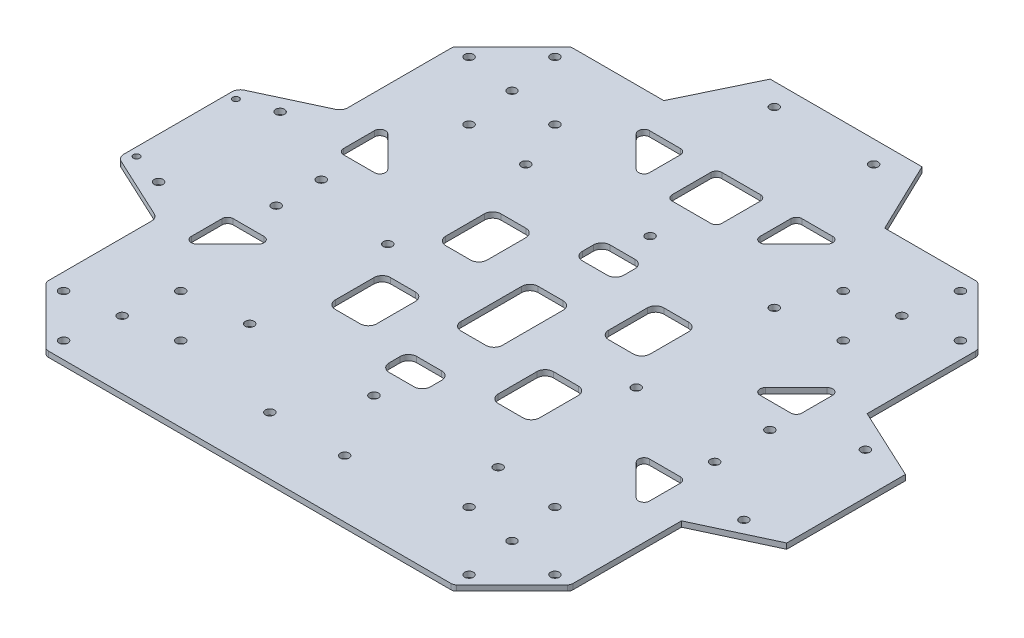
from build123d import *

# Parameters (mm, degrees)
SKETCH_1_R             = 1.6
EXTRUDE_1_DEPTH        = 2
FILLET_1_R             = 2
SKETCH_2_W             = 18
SKETCH_2_H             = 18
CUT_EXTRUDE_1_DEPTH    = 135.365174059
FILLET_2_R             = 2
EXTRUDE_2_DEPTH        = 2
FILLET_3_R             = 3
SKETCH_5_R             = 1.6
SKETCH_5_W             = 15
SKETCH_5_H             = 20
SKETCH_5_H_2           = 28
SKETCH_5_H_3           = 10
CUT_EXTRUDE_3_DEPTH    = 10
FILLET_4_R             = 3
SKETCH_6_R             = 1.15
CUT_EXTRUDE_8568_DEPTH = 10
SKETCH_7_R             = 1.6
EXTRUDE_3_DEPTH        = 2
SKETCH_8_R             = 1.6
CUT_EXTRUDE_4_DEPTH    = 10


with BuildPart() as part:
    # Sketch 1 → Extrude 1 (new body)
    with BuildSketch(Plane(origin=(0, 0, 0), x_dir=(1, 0, 0), z_dir=(0, 1, 0))):
        Polygon((95, -73.786796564), (95, 73.786796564), (73.786796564, 95), (-73.786796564, 95), (-95, 73.786796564), (-95, -73.786796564), (-73.786796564, -95), (73.786796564, -95), align=None)
        with Locations(Location((-88.98959236, -73.433243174, 0), (0, 0, 270))):
            Circle(SKETCH_1_R, mode=Mode.SUBTRACT)
        with Locations(Location((-73.433243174, -88.98959236, 0), (0, 0, 270))):
            Circle(SKETCH_1_R, mode=Mode.SUBTRACT)
        with Locations(Location((-73.433243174, 88.98959236, 0), (0, 0, 270))):
            Circle(SKETCH_1_R, mode=Mode.SUBTRACT)
        with Locations(Location((-88.98959236, 73.433243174, 0), (0, 0, 270))):
            Circle(SKETCH_1_R, mode=Mode.SUBTRACT)
        with Locations(Location((73.433243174, 88.98959236, 0), (0, 0, 270))):
            Circle(SKETCH_1_R, mode=Mode.SUBTRACT)
        with Locations(Location((88.98959236, 73.433243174, 0), (0, 0, 270))):
            Circle(SKETCH_1_R, mode=Mode.SUBTRACT)
        with Locations(Location((88.98959236, -73.433243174, 0), (0, 0, 270))):
            Circle(SKETCH_1_R, mode=Mode.SUBTRACT)
        with Locations(Location((73.433243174, -88.98959236, 0), (0, 0, 270))):
            Circle(SKETCH_1_R, mode=Mode.SUBTRACT)
        with Locations(Location((-67.776388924, -52.220039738, 0), (0, 0, 270))):
            Circle(SKETCH_1_R, mode=Mode.SUBTRACT)
        with Locations(Location((-52.220039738, -67.776388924, 0), (0, 0, 270))):
            Circle(SKETCH_1_R, mode=Mode.SUBTRACT)
        with Locations(Location((67.776388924, -52.220039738, 0), (0, 0, 270))):
            Circle(SKETCH_1_R, mode=Mode.SUBTRACT)
        with Locations(Location((52.220039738, -67.776388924, 0), (0, 0, 270))):
            Circle(SKETCH_1_R, mode=Mode.SUBTRACT)
        with Locations(Location((67.776388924, 52.220039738, 0), (0, 0, 270))):
            Circle(SKETCH_1_R, mode=Mode.SUBTRACT)
        with Locations(Location((52.220039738, 67.776388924, 0), (0, 0, 270))):
            Circle(SKETCH_1_R, mode=Mode.SUBTRACT)
        with Locations(Location((-67.776388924, 52.220039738, 0), (0, 0, 270))):
            Circle(SKETCH_1_R, mode=Mode.SUBTRACT)
        with Locations(Location((-52.220039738, 67.776388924, 0), (0, 0, 270))):
            Circle(SKETCH_1_R, mode=Mode.SUBTRACT)
        with Locations(Location((-70.604816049, -70.604816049, 0), (0, 0, 270))):
            Circle(SKETCH_1_R, mode=Mode.SUBTRACT)
        with Locations(Location((-70.604816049, 70.604816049, 0), (0, 0, 270))):
            Circle(SKETCH_1_R, mode=Mode.SUBTRACT)
        with Locations(Location((70.604816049, -70.604816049, 0), (0, 0, 270))):
            Circle(SKETCH_1_R, mode=Mode.SUBTRACT)
        with Locations(Location((70.604816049, 70.604816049, 0), (0, 0, 270))):
            Circle(SKETCH_1_R, mode=Mode.SUBTRACT)
    extrude(amount=EXTRUDE_1_DEPTH)

    # Fillet 1
    fillet_1_edges = [part.edges().sort_by_distance(p)[0] for p in [
        (-73.786796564, 1, 95),
        (-95, 1, 73.786796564),
        (-95, 1, -73.786796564),
        (-73.786796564, 1, -95),
        (73.786796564, 1, -95),
        (95, 1, -73.786796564),
        (95, 1, 73.786796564),
        (73.786796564, 1, 95),
    ]]
    fillet(fillet_1_edges, radius=FILLET_1_R)

    # Sketch 2 → Cut-Extrude 1 (cut, through all)
    with BuildSketch(Plane(origin=(0, 2, 0), x_dir=(1, 0, 0), z_dir=(0, 1, 0))):
        Polygon((-65, 20), (-83, 38), (-83, 20), align=None)
        Polygon((-83, -38), (-83, -20), (-65, -20), align=None)
        Polygon((20, 65), (38, 83), (20, 83), align=None)
        Polygon((-38, 83), (-20, 83), (-20, 65), align=None)
        with Locations((0, 74)):
            Rectangle(SKETCH_2_W, SKETCH_2_H)
        Polygon((65, -20), (83, -38), (83, -20), align=None)
        Polygon((83, 38), (83, 20), (65, 20), align=None)
    extrude(amount=-CUT_EXTRUDE_1_DEPTH, mode=Mode.SUBTRACT)

    # Fillet 2
    fillet_2_edges = [part.edges().sort_by_distance(p)[0] for p in [
        (65, 1, -20),
        (83, 1, -38),
        (83, 1, -20),
        (65, 1, 20),
        (83, 1, 20),
        (83, 1, 38),
        (-65, 1, 20),
        (-83, 1, 38),
        (-83, 1, 20),
        (20, 1, -65),
        (20, 1, -83),
        (38, 1, -83),
        (-20, 1, -65),
        (-38, 1, -83),
        (-20, 1, -83),
        (9, 1, -83),
        (9, 1, -65),
        (-9, 1, -65),
        (-9, 1, -83),
        (-65, 1, -20),
        (-83, 1, -20),
        (-83, 1, -38),
    ]]
    fillet(fillet_2_edges, radius=FILLET_2_R)

    # Sketch 4 → Extrude 2 (add)
    with BuildSketch(Plane(origin=(0, 2, 0), x_dir=(1, 0, 0), z_dir=(0, 1, 0))):
        Polygon((-121, -21.5), (-95, -33.623999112), (-95, -21.5), (-95, 21.5), (-95, 33.623999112), (-121, 21.5), align=None)
        Polygon((95, 33.623999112), (95, 21.5), (95, -21.5), (95, -33.623999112), (121, -21.5), (121, 21.5), align=None)
    extrude(amount=-EXTRUDE_2_DEPTH)

    # Fillet 3
    fillet_3_edges = [part.edges().sort_by_distance(p)[0] for p in [
        (-95, 1, 33.623999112),
        (-121, 1, 21.5),
        (-121, 1, -21.5),
        (-95, 1, -33.623999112),
    ]]
    fillet(fillet_3_edges, radius=FILLET_3_R)

    # Sketch 5 → Cut-Extrude 3 (cut)
    with BuildSketch(Plane.XZ):
        with Locations(Location((-106, 22, 0), (0, 0, 90))):
            Circle(SKETCH_5_R)
        with Locations(Location((-106, -22, 0), (0, 0, 270))):
            Circle(SKETCH_5_R)
        with Locations(Location((106, -22, 0), (0, 0, 90))):
            Circle(SKETCH_5_R)
        with Locations(Location((106, 22, 0), (0, 0, 270))):
            Circle(SKETCH_5_R)
        with Locations(Location((82.5, -10.895903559, 0), (0, 0, 270))):
            Circle(SKETCH_5_R)
        with Locations(Location((82.5, 9.104096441, 0), (0, 0, 270))):
            Circle(SKETCH_5_R)
        with Locations(Location((-77.25, 8.16, 0), (0, 0, 270))):
            Circle(SKETCH_5_R)
        with Locations(Location((-77.25, -8.16, 0), (0, 0, 90))):
            Circle(SKETCH_5_R)
        with Locations(Location((13.55, 74.15, 0), (0, 0, 270))):
            Circle(SKETCH_5_R)
        with Locations(Location((-13.55, 74.15, 0), (0, 0, 270))):
            Circle(SKETCH_5_R)
        with Locations((-29.5, -20)):
            Rectangle(SKETCH_5_W, SKETCH_5_H)
        Rectangle(SKETCH_5_W, SKETCH_5_H_2)
        with Locations((-29.5, 20)):
            Rectangle(SKETCH_5_W, SKETCH_5_H)
        with Locations((29.5, 20)):
            Rectangle(SKETCH_5_W, SKETCH_5_H)
        with Locations((29.5, -20)):
            Rectangle(SKETCH_5_W, SKETCH_5_H)
        with Locations((0, -35)):
            Rectangle(SKETCH_5_W, SKETCH_5_H_3)
        with Locations((0, 35)):
            Rectangle(SKETCH_5_W, SKETCH_5_H_3)
    extrude(amount=-CUT_EXTRUDE_3_DEPTH, mode=Mode.SUBTRACT)

    # Fillet 4
    fillet_4_edges = [part.edges().sort_by_distance(p)[0] for p in [
        (-7.5, 1, -40),
        (-7.5, 1, -30),
        (7.5, 1, -30),
        (7.5, 1, -40),
        (37, 1, -30),
        (22, 1, -30),
        (22, 1, -10),
        (37, 1, -10),
        (-37, 1, -30),
        (-37, 1, -10),
        (-22, 1, -10),
        (-22, 1, -30),
        (37, 1, 30),
        (37, 1, 10),
        (22, 1, 10),
        (22, 1, 30),
        (7.5, 1, 40),
        (7.5, 1, 30),
        (-7.5, 1, 30),
        (-7.5, 1, 40),
        (7.5, 1, 14),
        (7.5, 1, -14),
        (-7.5, 1, -14),
        (-7.5, 1, 14),
        (-37, 1, 10),
        (-37, 1, 30),
        (-22, 1, 30),
        (-22, 1, 10),
    ]]
    fillet(fillet_4_edges, radius=FILLET_4_R)

    # Sketch 6 → Cut-Extrude 8568 (cut)
    with BuildSketch(Plane.XZ):
        with Locations(Location((-118, 18, 0), (0, 0, 270))):
            Circle(SKETCH_6_R)
        with Locations(Location((-118, -18, 0), (0, 0, 270))):
            Circle(SKETCH_6_R)
    extrude(amount=-CUT_EXTRUDE_8568_DEPTH, mode=Mode.SUBTRACT)

    # Sketch 7 → Extrude 3 (add)
    with BuildSketch(Plane(origin=(0, 2, 0), x_dir=(1, 0, 0), z_dir=(0, 1, 0))):
        Polygon((-40, 95), (-27.5, 121), (27.5, 121), (40, 95), align=None)
        with Locations(Location((18, 113, 0), (0, 0, 270))):
            Circle(SKETCH_7_R, mode=Mode.SUBTRACT)
        with Locations(Location((-18, 113, 0), (0, 0, 270))):
            Circle(SKETCH_7_R, mode=Mode.SUBTRACT)
    extrude(amount=-EXTRUDE_3_DEPTH)

    # Sketch 8 → Cut-Extrude 4 (cut)
    with BuildSketch(Plane(origin=(0, 2, 0), x_dir=(1, 0, 0), z_dir=(0, 1, 0))):
        with Locations(Location((-45, 50, 0), (0, 0, 270))):
            Circle(SKETCH_8_R)
        with Locations(Location((-45, -50, 0), (0, 0, 270))):
            Circle(SKETCH_8_R)
        with Locations(Location((45, -50, 0), (0, 0, 270))):
            Circle(SKETCH_8_R)
        with Locations(Location((45, 50, 0), (0, 0, 270))):
            Circle(SKETCH_8_R)
        with Locations(Location((0, -50, 0), (0, 0, 270))):
            Circle(SKETCH_8_R)
        with Locations(Location((0, 50, 0), (0, 0, 270))):
            Circle(SKETCH_8_R)
        with Locations(Location((45, 0, 0), (0, 0, 270))):
            Circle(SKETCH_8_R)
        with Locations(Location((-45, 0, 0), (0, 0, 270))):
            Circle(SKETCH_8_R)
    extrude(amount=-CUT_EXTRUDE_4_DEPTH, mode=Mode.SUBTRACT)


solid = part.part
